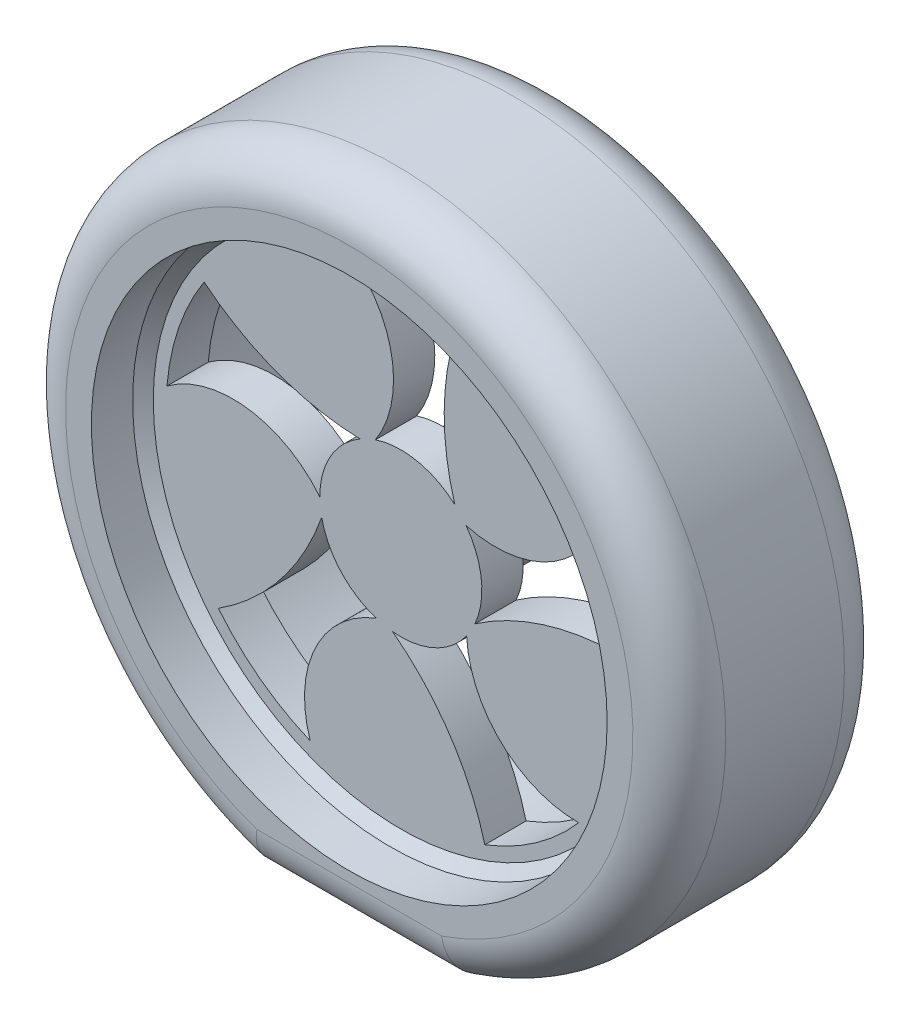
ISO-10303-21;
HEADER;
FILE_DESCRIPTION(('STEP AP214'),'2;1');
FILE_NAME('part.step','',(''),(''),'','','');
FILE_SCHEMA(('AUTOMOTIVE_DESIGN { 1 0 10303 214 1 1 1 1 }'));
ENDSEC;
DATA;
#1=APPLICATION_CONTEXT('core data for automotive mechanical design processes');
#2=APPLICATION_PROTOCOL_DEFINITION('international standard','automotive_design',2000,#1);
#3=PRODUCT_CONTEXT('',#1,'mechanical');
#4=PRODUCT('Part','Part','',(#3));
#5=PRODUCT_RELATED_PRODUCT_CATEGORY('part','',(#4));
#6=PRODUCT_DEFINITION_FORMATION('','',#4);
#7=PRODUCT_DEFINITION_CONTEXT('part definition',#1,'design');
#8=PRODUCT_DEFINITION('design','',#6,#7);
#9=PRODUCT_DEFINITION_SHAPE('','',#8);
#10=(LENGTH_UNIT() NAMED_UNIT(*) SI_UNIT(.MILLI.,.METRE.));
#11=(NAMED_UNIT(*) PLANE_ANGLE_UNIT() SI_UNIT($,.RADIAN.));
#12=(NAMED_UNIT(*) SI_UNIT($,.STERADIAN.) SOLID_ANGLE_UNIT());
#13=UNCERTAINTY_MEASURE_WITH_UNIT(LENGTH_MEASURE(1.E-05),#10,'distance_accuracy_value','');
#14=(GEOMETRIC_REPRESENTATION_CONTEXT(3) GLOBAL_UNCERTAINTY_ASSIGNED_CONTEXT((#13)) GLOBAL_UNIT_ASSIGNED_CONTEXT((#10,
#11,#12)) REPRESENTATION_CONTEXT('',''));
#15=CARTESIAN_POINT('',(0.,0.,0.));
#16=DIRECTION('',(0.,0.,1.));
#17=DIRECTION('',(1.,0.,0.));
#18=AXIS2_PLACEMENT_3D('',#15,#16,#17);
#19=CARTESIAN_POINT('',(0.,0.,115.));
#20=DIRECTION('',(0.,0.,-1.));
#21=DIRECTION('',(-1.,0.,0.));
#22=AXIS2_PLACEMENT_3D('',#19,#20,#21);
#23=PLANE('',#22);
#24=CARTESIAN_POINT('',(0.,0.,115.));
#25=DIRECTION('',(0.,0.,-1.));
#26=DIRECTION('',(-1.,0.,0.));
#27=AXIS2_PLACEMENT_3D('',#24,#25,#26);
#28=CIRCLE('',#27,227.49505489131);
#29=CARTESIAN_POINT('',(-226.727033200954,18.6775912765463,115.));
#30=VERTEX_POINT('',#29);
#31=CARTESIAN_POINT('',(-190.715894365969,124.021964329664,115.));
#32=VERTEX_POINT('',#31);
#33=EDGE_CURVE('E197',#30,#32,#28,.T.);
#34=ORIENTED_EDGE('',*,*,#33,.F.);
#35=CARTESIAN_POINT('',(-162.563216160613,-68.0513113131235,115.));
#36=DIRECTION('',(0.,0.,-1.));
#37=DIRECTION('',(-1.,0.,0.));
#38=AXIS2_PLACEMENT_3D('',#35,#36,#37);
#39=CIRCLE('',#38,107.883724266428);
#40=CARTESIAN_POINT('',(-78.5484642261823,-0.372515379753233,115.));
#41=VERTEX_POINT('',#40);
#42=EDGE_CURVE('E210',#41,#30,#39,.F.);
#43=ORIENTED_EDGE('',*,*,#42,.F.);
#44=CARTESIAN_POINT('',(0.,0.,115.));
#45=DIRECTION('',(0.,0.,-1.));
#46=DIRECTION('',(-1.,0.,0.));
#47=AXIS2_PLACEMENT_3D('',#44,#45,#46);
#48=CIRCLE('',#47,78.5493475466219);
#49=CARTESIAN_POINT('',(-39.5396561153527,67.8720531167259,115.));
#50=VERTEX_POINT('',#49);
#51=EDGE_CURVE('E223',#50,#41,#48,.F.);
#52=ORIENTED_EDGE('',*,*,#51,.F.);
#53=CARTESIAN_POINT('',(-33.3873778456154,316.022259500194,115.));
#54=DIRECTION('',(0.,0.,-1.));
#55=DIRECTION('',(-1.,0.,0.));
#56=AXIS2_PLACEMENT_3D('',#53,#54,#55);
#57=CIRCLE('',#56,248.22646002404);
#58=EDGE_CURVE('E225',#32,#50,#57,.F.);
#59=ORIENTED_EDGE('',*,*,#58,.F.);
#60=EDGE_LOOP('',(#34,#43,#52,#59));
#61=FACE_BOUND('',#60,.T.);
#62=CARTESIAN_POINT('',(0.,0.,115.));
#63=DIRECTION('',(0.,0.,-1.));
#64=DIRECTION('',(-1.,0.,0.));
#65=AXIS2_PLACEMENT_3D('',#62,#63,#64);
#66=CIRCLE('',#65,227.49505489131);
#67=CARTESIAN_POINT('',(-87.8259512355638,-209.858529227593,115.));
#68=VERTEX_POINT('',#67);
#69=CARTESIAN_POINT('',(-176.886349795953,-143.056699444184,115.));
#70=VERTEX_POINT('',#69);
#71=EDGE_CURVE('E255',#68,#70,#66,.T.);
#72=ORIENTED_EDGE('',*,*,#71,.F.);
#73=CARTESIAN_POINT('',(14.4858466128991,-175.635817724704,115.));
#74=DIRECTION('',(0.,0.,-1.));
#75=DIRECTION('',(-1.,0.,0.));
#76=AXIS2_PLACEMENT_3D('',#73,#74,#75);
#77=CIRCLE('',#76,107.883724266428);
#78=CARTESIAN_POINT('',(-23.9185271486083,-74.8191423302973,115.));
#79=VERTEX_POINT('',#78);
#80=EDGE_CURVE('E242',#79,#68,#77,.F.);
#81=ORIENTED_EDGE('',*,*,#80,.F.);
#82=CARTESIAN_POINT('',(0.,0.,115.));
#83=DIRECTION('',(0.,0.,-1.));
#84=DIRECTION('',(-1.,0.,0.));
#85=AXIS2_PLACEMENT_3D('',#82,#83,#84);
#86=CIRCLE('',#85,78.5493475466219);
#87=CARTESIAN_POINT('',(-76.7685840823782,-16.6308297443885,115.));
#88=VERTEX_POINT('',#87);
#89=EDGE_CURVE('E250',#88,#79,#86,.F.);
#90=ORIENTED_EDGE('',*,*,#89,.F.);
#91=CARTESIAN_POINT('',(-310.872296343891,65.9029655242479,115.));
#92=DIRECTION('',(0.,0.,-1.));
#93=DIRECTION('',(-1.,0.,0.));
#94=AXIS2_PLACEMENT_3D('',#91,#92,#93);
#95=CIRCLE('',#94,248.22646002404);
#96=EDGE_CURVE('E253',#70,#88,#95,.F.);
#97=ORIENTED_EDGE('',*,*,#96,.F.);
#98=EDGE_LOOP('',(#72,#81,#90,#97));
#99=FACE_BOUND('',#98,.T.);
#100=CARTESIAN_POINT('',(0.,0.,115.));
#101=DIRECTION('',(0.,0.,-1.));
#102=DIRECTION('',(-1.,0.,0.));
#103=AXIS2_PLACEMENT_3D('',#100,#101,#102);
#104=CIRCLE('',#103,227.49505489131);
#105=CARTESIAN_POINT('',(172.447610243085,-148.377295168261,115.));
#106=VERTEX_POINT('',#105);
#107=CARTESIAN_POINT('',(81.3941180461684,-212.435866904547,115.));
#108=VERTEX_POINT('',#107);
#109=EDGE_CURVE('E284',#106,#108,#104,.T.);
#110=ORIENTED_EDGE('',*,*,#109,.F.);
#111=CARTESIAN_POINT('',(171.515961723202,-40.4975936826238,115.));
#112=DIRECTION('',(0.,0.,-1.));
#113=DIRECTION('',(-1.,0.,0.));
#114=AXIS2_PLACEMENT_3D('',#111,#112,#113);
#115=CIRCLE('',#114,107.883724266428);
#116=CARTESIAN_POINT('',(63.7660014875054,-45.8682575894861,115.));
#117=VERTEX_POINT('',#116);
#118=EDGE_CURVE('E271',#117,#106,#115,.F.);
#119=ORIENTED_EDGE('',*,*,#118,.F.);
#120=CARTESIAN_POINT('',(0.,0.,115.));
#121=DIRECTION('',(0.,0.,-1.));
#122=DIRECTION('',(-1.,0.,0.));
#123=AXIS2_PLACEMENT_3D('',#120,#121,#122);
#124=CIRCLE('',#123,78.5493475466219);
#125=CARTESIAN_POINT('',(-7.90593811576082,-78.1504711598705,115.));
#126=VERTEX_POINT('',#125);
#127=EDGE_CURVE('E279',#126,#117,#124,.F.);
#128=ORIENTED_EDGE('',*,*,#127,.F.);
#129=CARTESIAN_POINT('',(-158.742267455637,-275.291986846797,115.));
#130=DIRECTION('',(0.,0.,-1.));
#131=DIRECTION('',(-1.,0.,0.));
#132=AXIS2_PLACEMENT_3D('',#129,#130,#131);
#133=CIRCLE('',#132,248.22646002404);
#134=EDGE_CURVE('E282',#108,#126,#133,.F.);
#135=ORIENTED_EDGE('',*,*,#134,.F.);
#136=EDGE_LOOP('',(#110,#119,#128,#135));
#137=FACE_BOUND('',#136,.T.);
#138=CARTESIAN_POINT('',(0.,0.,115.));
#139=DIRECTION('',(0.,0.,-1.));
#140=DIRECTION('',(-1.,0.,0.));
#141=AXIS2_PLACEMENT_3D('',#138,#139,#140);
#142=CIRCLE('',#141,227.49505489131);
#143=CARTESIAN_POINT('',(194.404435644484,118.156317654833,115.));
#144=VERTEX_POINT('',#143);
#145=CARTESIAN_POINT('',(227.190681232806,11.7641132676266,115.));
#146=VERTEX_POINT('',#145);
#147=EDGE_CURVE('E313',#144,#146,#142,.T.);
#148=ORIENTED_EDGE('',*,*,#147,.F.);
#149=CARTESIAN_POINT('',(91.5168473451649,150.60692836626,115.));
#150=DIRECTION('',(0.,0.,-1.));
#151=DIRECTION('',(-1.,0.,0.));
#152=AXIS2_PLACEMENT_3D('',#149,#150,#151);
#153=CIRCLE('',#152,107.883724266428);
#154=CARTESIAN_POINT('',(63.3280833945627,46.4710001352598,115.));
#155=VERTEX_POINT('',#154);
#156=EDGE_CURVE('E300',#155,#144,#153,.F.);
#157=ORIENTED_EDGE('',*,*,#156,.F.);
#158=CARTESIAN_POINT('',(0.,0.,115.));
#159=DIRECTION('',(0.,0.,-1.));
#160=DIRECTION('',(-1.,0.,0.));
#161=AXIS2_PLACEMENT_3D('',#158,#159,#160);
#162=CIRCLE('',#161,78.5493475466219);
#163=CARTESIAN_POINT('',(71.8824456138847,-31.6688176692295,115.));
#164=VERTEX_POINT('',#163);
#165=EDGE_CURVE('E308',#164,#155,#162,.F.);
#166=ORIENTED_EDGE('',*,*,#165,.F.);
#167=CARTESIAN_POINT('',(212.764179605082,-236.042770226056,115.));
#168=DIRECTION('',(0.,0.,-1.));
#169=DIRECTION('',(-1.,0.,0.));
#170=AXIS2_PLACEMENT_3D('',#167,#168,#169);
#171=CIRCLE('',#170,248.22646002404);
#172=EDGE_CURVE('E311',#146,#164,#171,.F.);
#173=ORIENTED_EDGE('',*,*,#172,.F.);
#174=EDGE_LOOP('',(#148,#157,#166,#173));
#175=FACE_BOUND('',#174,.T.);
#176=CARTESIAN_POINT('',(0.,0.,115.));
#177=DIRECTION('',(0.,0.,-1.));
#178=DIRECTION('',(-1.,0.,0.));
#179=AXIS2_PLACEMENT_3D('',#176,#177,#178);
#180=CIRCLE('',#179,227.49505489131);
#181=CARTESIAN_POINT('',(-52.2990614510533,221.401915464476,115.));
#182=VERTEX_POINT('',#181);
#183=CARTESIAN_POINT('',(59.0174448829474,219.706488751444,115.));
#184=VERTEX_POINT('',#183);
#185=EDGE_CURVE('E342',#182,#184,#180,.T.);
#186=ORIENTED_EDGE('',*,*,#185,.F.);
#187=CARTESIAN_POINT('',(-114.955439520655,133.577794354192,115.));
#188=DIRECTION('',(0.,0.,-1.));
#189=DIRECTION('',(-1.,0.,0.));
#190=AXIS2_PLACEMENT_3D('',#187,#188,#189);
#191=CIRCLE('',#190,107.883724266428);
#192=CARTESIAN_POINT('',(-24.6270935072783,74.5889151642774,115.));
#193=VERTEX_POINT('',#192);
#194=EDGE_CURVE('E329',#193,#182,#191,.F.);
#195=ORIENTED_EDGE('',*,*,#194,.F.);
#196=CARTESIAN_POINT('',(0.,0.,115.));
#197=DIRECTION('',(0.,0.,-1.));
#198=DIRECTION('',(-1.,0.,0.));
#199=AXIS2_PLACEMENT_3D('',#196,#197,#198);
#200=CIRCLE('',#199,78.5493475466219);
#201=CARTESIAN_POINT('',(52.331732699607,58.5780654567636,115.));
#202=VERTEX_POINT('',#201);
#203=EDGE_CURVE('E337',#202,#193,#200,.F.);
#204=ORIENTED_EDGE('',*,*,#203,.F.);
#205=CARTESIAN_POINT('',(290.237762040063,129.409532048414,115.));
#206=DIRECTION('',(0.,0.,-1.));
#207=DIRECTION('',(-1.,0.,0.));
#208=AXIS2_PLACEMENT_3D('',#205,#206,#207);
#209=CIRCLE('',#208,248.22646002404);
#210=EDGE_CURVE('E340',#184,#202,#209,.F.);
#211=ORIENTED_EDGE('',*,*,#210,.F.);
#212=EDGE_LOOP('',(#186,#195,#204,#211));
#213=FACE_BOUND('',#212,.T.);
#214=CARTESIAN_POINT('',(0.,0.,115.));
#215=DIRECTION('',(0.,0.,-1.));
#216=DIRECTION('',(-1.,0.,0.));
#217=AXIS2_PLACEMENT_3D('',#214,#215,#216);
#218=CIRCLE('',#217,250.);
#219=CARTESIAN_POINT('',(-250.,0.,115.));
#220=VERTEX_POINT('',#219);
#221=EDGE_CURVE('E359',#220,#220,#218,.T.);
#222=ORIENTED_EDGE('',*,*,#221,.T.);
#223=EDGE_LOOP('',(#222));
#224=FACE_BOUND('',#223,.T.);
#225=CARTESIAN_POINT('',(0.,0.,115.));
#226=DIRECTION('',(0.,0.,-1.));
#227=DIRECTION('',(-1.,0.,0.));
#228=AXIS2_PLACEMENT_3D('',#225,#226,#227);
#229=CIRCLE('',#228,55.);
#230=CARTESIAN_POINT('',(-55.,0.,115.));
#231=VERTEX_POINT('',#230);
#232=EDGE_CURVE('E350',#231,#231,#229,.T.);
#233=ORIENTED_EDGE('',*,*,#232,.F.);
#234=EDGE_LOOP('',(#233));
#235=FACE_BOUND('',#234,.T.);
#236=ADVANCED_FACE('F33',(#61,#99,#137,#175,#213,#224,#235),#23,.T.);
#237=CARTESIAN_POINT('',(0.,0.,205.));
#238=DIRECTION('',(0.,0.,-1.));
#239=DIRECTION('',(-1.,0.,0.));
#240=AXIS2_PLACEMENT_3D('',#237,#238,#239);
#241=CYLINDRICAL_SURFACE('',#240,320.);
#242=DIRECTION('',(0.,0.,-1.));
#243=VECTOR('',#242,1.);
#244=CARTESIAN_POINT('',(-96.8245836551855,-305.,205.));
#245=LINE('',#244,#243);
#246=CARTESIAN_POINT('',(-96.8245836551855,-305.,160.));
#247=VERTEX_POINT('',#246);
#248=CARTESIAN_POINT('',(-96.8245836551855,-305.,45.));
#249=VERTEX_POINT('',#248);
#250=EDGE_CURVE('E409',#247,#249,#245,.T.);
#251=ORIENTED_EDGE('',*,*,#250,.F.);
#252=CARTESIAN_POINT('',(0.,0.,160.));
#253=DIRECTION('',(0.,0.,1.));
#254=DIRECTION('',(1.,0.,0.));
#255=AXIS2_PLACEMENT_3D('',#252,#253,#254);
#256=CIRCLE('',#255,320.);
#257=CARTESIAN_POINT('',(96.8245836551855,-305.,160.));
#258=VERTEX_POINT('',#257);
#259=EDGE_CURVE('E420',#247,#258,#256,.F.);
#260=ORIENTED_EDGE('',*,*,#259,.T.);
#261=DIRECTION('',(0.,0.,-1.));
#262=VECTOR('',#261,1.);
#263=CARTESIAN_POINT('',(96.8245836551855,-305.,205.));
#264=LINE('',#263,#262);
#265=CARTESIAN_POINT('',(96.8245836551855,-305.,45.));
#266=VERTEX_POINT('',#265);
#267=EDGE_CURVE('E406',#258,#266,#264,.T.);
#268=ORIENTED_EDGE('',*,*,#267,.T.);
#269=CARTESIAN_POINT('',(0.,0.,45.));
#270=DIRECTION('',(0.,0.,1.));
#271=DIRECTION('',(1.,0.,0.));
#272=AXIS2_PLACEMENT_3D('',#269,#270,#271);
#273=CIRCLE('',#272,320.);
#274=EDGE_CURVE('E417',#266,#249,#273,.T.);
#275=ORIENTED_EDGE('',*,*,#274,.T.);
#276=EDGE_LOOP('',(#251,#260,#268,#275));
#277=FACE_BOUND('',#276,.T.);
#278=ADVANCED_FACE('F35',(#277),#241,.T.);
#279=CARTESIAN_POINT('',(-96.8245836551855,-305.,205.));
#280=DIRECTION('',(0.,1.,0.));
#281=DIRECTION('',(0.,0.,1.));
#282=AXIS2_PLACEMENT_3D('',#279,#280,#281);
#283=PLANE('',#282);
#284=ORIENTED_EDGE('',*,*,#267,.F.);
#285=DIRECTION('',(1.,0.,0.));
#286=VECTOR('',#285,1.);
#287=CARTESIAN_POINT('',(-96.8245836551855,-305.,160.));
#288=LINE('',#287,#286);
#289=EDGE_CURVE('E430',#258,#247,#288,.F.);
#290=ORIENTED_EDGE('',*,*,#289,.T.);
#291=ORIENTED_EDGE('',*,*,#250,.T.);
#292=DIRECTION('',(1.,0.,0.));
#293=VECTOR('',#292,1.);
#294=CARTESIAN_POINT('',(-96.8245836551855,-305.,45.));
#295=LINE('',#294,#293);
#296=EDGE_CURVE('E428',#249,#266,#295,.T.);
#297=ORIENTED_EDGE('',*,*,#296,.T.);
#298=EDGE_LOOP('',(#284,#290,#291,#297));
#299=FACE_BOUND('',#298,.T.);
#300=ADVANCED_FACE('F453',(#299),#283,.F.);
#301=CARTESIAN_POINT('',(0.,0.,205.));
#302=DIRECTION('',(0.,0.,1.));
#303=DIRECTION('',(1.,0.,0.));
#304=AXIS2_PLACEMENT_3D('',#301,#302,#303);
#305=PLANE('',#304);
#306=CARTESIAN_POINT('',(0.,0.,205.));
#307=DIRECTION('',(0.,0.,1.));
#308=DIRECTION('',(1.,0.,0.));
#309=AXIS2_PLACEMENT_3D('',#306,#307,#308);
#310=CIRCLE('',#309,250.);
#311=CARTESIAN_POINT('',(250.,0.,205.));
#312=VERTEX_POINT('',#311);
#313=EDGE_CURVE('E362',#312,#312,#310,.T.);
#314=ORIENTED_EDGE('',*,*,#313,.F.);
#315=EDGE_LOOP('',(#314));
#316=FACE_BOUND('',#315,.T.);
#317=DIRECTION('',(1.,0.,0.));
#318=VECTOR('',#317,1.);
#319=CARTESIAN_POINT('',(96.8245836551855,-260.,205.));
#320=LINE('',#319,#318);
#321=CARTESIAN_POINT('',(-89.5823643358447,-260.,205.));
#322=VERTEX_POINT('',#321);
#323=CARTESIAN_POINT('',(89.5823643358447,-260.,205.));
#324=VERTEX_POINT('',#323);
#325=EDGE_CURVE('E412',#322,#324,#320,.T.);
#326=ORIENTED_EDGE('',*,*,#325,.T.);
#327=CARTESIAN_POINT('',(0.,0.,205.));
#328=DIRECTION('',(0.,0.,1.));
#329=DIRECTION('',(1.,0.,0.));
#330=AXIS2_PLACEMENT_3D('',#327,#328,#329);
#331=CIRCLE('',#330,275.);
#332=EDGE_CURVE('E414',#324,#322,#331,.T.);
#333=ORIENTED_EDGE('',*,*,#332,.T.);
#334=EDGE_LOOP('',(#326,#333));
#335=FACE_BOUND('',#334,.T.);
#336=ADVANCED_FACE('F472',(#316,#335),#305,.T.);
#337=CARTESIAN_POINT('',(0.,0.,0.));
#338=DIRECTION('',(0.,0.,1.));
#339=DIRECTION('',(1.,0.,0.));
#340=AXIS2_PLACEMENT_3D('',#337,#338,#339);
#341=PLANE('',#340);
#342=CARTESIAN_POINT('',(0.,0.,0.));
#343=DIRECTION('',(0.,0.,-1.));
#344=DIRECTION('',(-1.,0.,0.));
#345=AXIS2_PLACEMENT_3D('',#342,#343,#344);
#346=CIRCLE('',#345,250.);
#347=CARTESIAN_POINT('',(-250.,0.,0.));
#348=VERTEX_POINT('',#347);
#349=EDGE_CURVE('E356',#348,#348,#346,.T.);
#350=ORIENTED_EDGE('',*,*,#349,.F.);
#351=EDGE_LOOP('',(#350));
#352=FACE_BOUND('',#351,.T.);
#353=DIRECTION('',(1.,0.,0.));
#354=VECTOR('',#353,1.);
#355=CARTESIAN_POINT('',(0.,-260.,0.));
#356=LINE('',#355,#354);
#357=CARTESIAN_POINT('',(89.5823643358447,-260.,0.));
#358=VERTEX_POINT('',#357);
#359=CARTESIAN_POINT('',(-89.5823643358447,-260.,0.));
#360=VERTEX_POINT('',#359);
#361=EDGE_CURVE('E423',#358,#360,#356,.F.);
#362=ORIENTED_EDGE('',*,*,#361,.T.);
#363=CARTESIAN_POINT('',(0.,0.,0.));
#364=DIRECTION('',(0.,0.,1.));
#365=DIRECTION('',(1.,0.,0.));
#366=AXIS2_PLACEMENT_3D('',#363,#364,#365);
#367=CIRCLE('',#366,275.);
#368=EDGE_CURVE('E425',#360,#358,#367,.F.);
#369=ORIENTED_EDGE('',*,*,#368,.T.);
#370=EDGE_LOOP('',(#362,#369));
#371=FACE_BOUND('',#370,.T.);
#372=ADVANCED_FACE('F475',(#352,#371),#341,.F.);
#373=CARTESIAN_POINT('',(0.,-260.,160.));
#374=DIRECTION('',(-1.,0.,0.));
#375=DIRECTION('',(0.,0.,1.));
#376=AXIS2_PLACEMENT_3D('',#373,#374,#375);
#377=CYLINDRICAL_SURFACE('',#376,45.);
#378=CARTESIAN_POINT('',(-96.8245836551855,-305.,160.));
#379=CARTESIAN_POINT('',(-96.8245846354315,-305.000008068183,160.627283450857));
#380=CARTESIAN_POINT('',(-96.8225517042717,-304.986883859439,161.254560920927));
#381=CARTESIAN_POINT('',(-96.8144256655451,-304.934432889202,162.507990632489));
#382=CARTESIAN_POINT('',(-96.8083325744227,-304.895106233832,163.134142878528));
#383=CARTESIAN_POINT('',(-96.7920944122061,-304.790315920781,164.384171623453));
#384=CARTESIAN_POINT('',(-96.7819496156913,-304.724854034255,165.008048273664));
#385=CARTESIAN_POINT('',(-96.7576261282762,-304.567935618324,166.252400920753));
#386=CARTESIAN_POINT('',(-96.7434474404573,-304.476479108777,166.872876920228));
#387=CARTESIAN_POINT('',(-96.6949208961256,-304.163555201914,168.72631461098));
#388=CARTESIAN_POINT('',(-96.654562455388,-303.903403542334,169.952831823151));
#389=CARTESIAN_POINT('',(-96.5580673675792,-303.281935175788,172.379134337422));
#390=CARTESIAN_POINT('',(-96.5019308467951,-302.920619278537,173.578919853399));
#391=CARTESIAN_POINT('',(-96.3741956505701,-302.099383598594,175.943937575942));
#392=CARTESIAN_POINT('',(-96.3025914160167,-301.639428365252,177.109157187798));
#393=CARTESIAN_POINT('',(-96.1443703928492,-300.624456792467,179.396365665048));
#394=CARTESIAN_POINT('',(-96.0577534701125,-300.069439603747,180.518354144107));
#395=CARTESIAN_POINT('',(-95.8700488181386,-298.868581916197,182.711135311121));
#396=CARTESIAN_POINT('',(-95.7689632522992,-298.222754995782,183.78193562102));
#397=CARTESIAN_POINT('',(-95.5529260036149,-296.84500014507,185.865140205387));
#398=CARTESIAN_POINT('',(-95.437974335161,-296.113072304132,186.877544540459));
#399=CARTESIAN_POINT('',(-95.1943049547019,-294.564692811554,188.841873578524));
#400=CARTESIAN_POINT('',(-95.0655225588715,-293.747844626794,189.793477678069));
#401=CARTESIAN_POINT('',(-94.795443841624,-292.038598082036,191.624304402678));
#402=CARTESIAN_POINT('',(-94.6541474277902,-291.146199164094,192.503526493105));
#403=CARTESIAN_POINT('',(-94.3598595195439,-289.292047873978,194.183940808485));
#404=CARTESIAN_POINT('',(-94.2068646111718,-288.330275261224,194.985110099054));
#405=CARTESIAN_POINT('',(-93.8901509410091,-286.344512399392,196.503823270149));
#406=CARTESIAN_POINT('',(-93.7264322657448,-285.320522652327,197.221367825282));
#407=CARTESIAN_POINT('',(-93.387348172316,-283.205591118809,198.575838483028));
#408=CARTESIAN_POINT('',(-93.211871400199,-282.114019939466,199.211754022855));
#409=CARTESIAN_POINT('',(-92.8520532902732,-279.882381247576,200.389139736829));
#410=CARTESIAN_POINT('',(-92.6677113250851,-278.742310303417,200.930603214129));
#411=CARTESIAN_POINT('',(-92.2914178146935,-276.422347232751,201.915319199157));
#412=CARTESIAN_POINT('',(-92.0994695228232,-275.242472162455,202.358613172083));
#413=CARTESIAN_POINT('',(-91.709130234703,-272.85088358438,203.144388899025));
#414=CARTESIAN_POINT('',(-91.5107408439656,-271.639178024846,203.486895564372));
#415=CARTESIAN_POINT('',(-91.1705310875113,-269.568210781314,203.979642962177));
#416=CARTESIAN_POINT('',(-91.0300477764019,-268.714985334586,204.156626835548));
#417=CARTESIAN_POINT('',(-90.7470159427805,-267.000029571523,204.460743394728));
#418=CARTESIAN_POINT('',(-90.6044675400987,-266.138299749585,204.587878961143));
#419=CARTESIAN_POINT('',(-90.3179918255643,-264.410638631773,204.791760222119));
#420=CARTESIAN_POINT('',(-90.1740671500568,-263.544716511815,204.868587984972));
#421=CARTESIAN_POINT('',(-89.8850807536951,-261.810229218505,204.971962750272));
#422=CARTESIAN_POINT('',(-89.7400193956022,-260.941664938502,204.99852518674));
#423=CARTESIAN_POINT('',(-89.5905480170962,-260.048875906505,204.999980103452));
#424=CARTESIAN_POINT('',(-89.586456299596,-260.02443785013,205.000000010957));
#425=CARTESIAN_POINT('',(-89.5823643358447,-260.,205.));
#426=B_SPLINE_CURVE_WITH_KNOTS('',3,(#378,#379,#380,#381,#382,#383,#384,#385,#386,#387,#388,
#389,#390,#391,#392,#393,#394,#395,#396,#397,#398,#399,#400,#401,#402,#403,#404,#405,#406,#407,
#408,#409,#410,#411,#412,#413,#414,#415,#416,#417,#418,#419,#420,#421,#422,#423,#424,#425),
.UNSPECIFIED.,.F.,.F.,(4,2,2,2,2,2,2,2,2,2,2,2,2,2,2,2,2,2,2,2,2,2,2,4),(0.,1.88169823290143,
3.76338884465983,5.6449519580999,7.5265136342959,11.2849976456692,15.0434515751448,
18.8032585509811,22.5630991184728,26.3223780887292,30.0816531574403,33.8593457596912,
37.6370662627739,41.4158934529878,45.1946901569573,49.0164973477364,52.8385754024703,
56.6590359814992,60.4785514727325,63.1251395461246,65.77157465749,68.4136817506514,
71.0549774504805,71.1293121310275),.UNSPECIFIED.);
#427=EDGE_CURVE('E396',#247,#322,#426,.T.);
#428=ORIENTED_EDGE('',*,*,#427,.F.);
#429=ORIENTED_EDGE('',*,*,#289,.F.);
#430=CARTESIAN_POINT('',(96.8245836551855,-305.,160.));
#431=CARTESIAN_POINT('',(96.8245846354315,-305.000008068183,160.627283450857));
#432=CARTESIAN_POINT('',(96.8225517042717,-304.986883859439,161.254560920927));
#433=CARTESIAN_POINT('',(96.8144256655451,-304.934432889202,162.507990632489));
#434=CARTESIAN_POINT('',(96.8083325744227,-304.895106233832,163.134142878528));
#435=CARTESIAN_POINT('',(96.7920944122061,-304.790315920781,164.384171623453));
#436=CARTESIAN_POINT('',(96.7819496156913,-304.724854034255,165.008048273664));
#437=CARTESIAN_POINT('',(96.7576261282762,-304.567935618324,166.252400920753));
#438=CARTESIAN_POINT('',(96.7434474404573,-304.476479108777,166.872876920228));
#439=CARTESIAN_POINT('',(96.6949208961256,-304.163555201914,168.72631461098));
#440=CARTESIAN_POINT('',(96.654562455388,-303.903403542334,169.952831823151));
#441=CARTESIAN_POINT('',(96.5580673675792,-303.281935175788,172.379134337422));
#442=CARTESIAN_POINT('',(96.5019308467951,-302.920619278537,173.578919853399));
#443=CARTESIAN_POINT('',(96.3741956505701,-302.099383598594,175.943937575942));
#444=CARTESIAN_POINT('',(96.3025914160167,-301.639428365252,177.109157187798));
#445=CARTESIAN_POINT('',(96.1443703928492,-300.624456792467,179.396365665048));
#446=CARTESIAN_POINT('',(96.0577534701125,-300.069439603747,180.518354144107));
#447=CARTESIAN_POINT('',(95.8700488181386,-298.868581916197,182.711135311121));
#448=CARTESIAN_POINT('',(95.7689632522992,-298.222754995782,183.78193562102));
#449=CARTESIAN_POINT('',(95.5529260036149,-296.84500014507,185.865140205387));
#450=CARTESIAN_POINT('',(95.437974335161,-296.113072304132,186.877544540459));
#451=CARTESIAN_POINT('',(95.1943049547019,-294.564692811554,188.841873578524));
#452=CARTESIAN_POINT('',(95.0655225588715,-293.747844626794,189.793477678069));
#453=CARTESIAN_POINT('',(94.795443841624,-292.038598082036,191.624304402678));
#454=CARTESIAN_POINT('',(94.6541474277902,-291.146199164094,192.503526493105));
#455=CARTESIAN_POINT('',(94.3598595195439,-289.292047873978,194.183940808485));
#456=CARTESIAN_POINT('',(94.2068646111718,-288.330275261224,194.985110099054));
#457=CARTESIAN_POINT('',(93.8901509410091,-286.344512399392,196.503823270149));
#458=CARTESIAN_POINT('',(93.7264322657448,-285.320522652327,197.221367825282));
#459=CARTESIAN_POINT('',(93.387348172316,-283.205591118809,198.575838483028));
#460=CARTESIAN_POINT('',(93.211871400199,-282.114019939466,199.211754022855));
#461=CARTESIAN_POINT('',(92.8520532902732,-279.882381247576,200.389139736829));
#462=CARTESIAN_POINT('',(92.6677113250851,-278.742310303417,200.930603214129));
#463=CARTESIAN_POINT('',(92.2914178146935,-276.422347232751,201.915319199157));
#464=CARTESIAN_POINT('',(92.0994695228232,-275.242472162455,202.358613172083));
#465=CARTESIAN_POINT('',(91.709130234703,-272.85088358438,203.144388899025));
#466=CARTESIAN_POINT('',(91.5107408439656,-271.639178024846,203.486895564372));
#467=CARTESIAN_POINT('',(91.1705310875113,-269.568210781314,203.979642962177));
#468=CARTESIAN_POINT('',(91.0300477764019,-268.714985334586,204.156626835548));
#469=CARTESIAN_POINT('',(90.7470159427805,-267.000029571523,204.460743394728));
#470=CARTESIAN_POINT('',(90.6044675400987,-266.138299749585,204.587878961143));
#471=CARTESIAN_POINT('',(90.3179918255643,-264.410638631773,204.791760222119));
#472=CARTESIAN_POINT('',(90.1740671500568,-263.544716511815,204.868587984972));
#473=CARTESIAN_POINT('',(89.8850807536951,-261.810229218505,204.971962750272));
#474=CARTESIAN_POINT('',(89.7400193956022,-260.941664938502,204.99852518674));
#475=CARTESIAN_POINT('',(89.5905480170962,-260.048875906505,204.999980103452));
#476=CARTESIAN_POINT('',(89.586456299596,-260.02443785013,205.000000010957));
#477=CARTESIAN_POINT('',(89.5823643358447,-260.,205.));
#478=B_SPLINE_CURVE_WITH_KNOTS('',3,(#430,#431,#432,#433,#434,#435,#436,#437,#438,#439,#440,
#441,#442,#443,#444,#445,#446,#447,#448,#449,#450,#451,#452,#453,#454,#455,#456,#457,#458,#459,
#460,#461,#462,#463,#464,#465,#466,#467,#468,#469,#470,#471,#472,#473,#474,#475,#476,#477),
.UNSPECIFIED.,.F.,.F.,(4,2,2,2,2,2,2,2,2,2,2,2,2,2,2,2,2,2,2,2,2,2,2,4),(0.,1.88169823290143,
3.76338884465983,5.6449519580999,7.5265136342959,11.2849976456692,15.0434515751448,
18.8032585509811,22.5630991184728,26.3223780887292,30.0816531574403,33.8593457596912,
37.6370662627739,41.4158934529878,45.1946901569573,49.0164973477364,52.8385754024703,
56.6590359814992,60.4785514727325,63.1251395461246,65.77157465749,68.4136817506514,
71.0549774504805,71.1293121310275),.UNSPECIFIED.);
#479=EDGE_CURVE('E401',#324,#258,#478,.F.);
#480=ORIENTED_EDGE('',*,*,#479,.F.);
#481=ORIENTED_EDGE('',*,*,#325,.F.);
#482=EDGE_LOOP('',(#428,#429,#480,#481));
#483=FACE_BOUND('',#482,.T.);
#484=ADVANCED_FACE('F391',(#483),#377,.T.);
#485=CARTESIAN_POINT('',(0.,0.,160.));
#486=DIRECTION('',(0.,0.,1.));
#487=DIRECTION('',(1.,0.,0.));
#488=AXIS2_PLACEMENT_3D('',#485,#486,#487);
#489=TOROIDAL_SURFACE('',#488,275.,45.);
#490=ORIENTED_EDGE('',*,*,#479,.T.);
#491=ORIENTED_EDGE('',*,*,#259,.F.);
#492=ORIENTED_EDGE('',*,*,#427,.T.);
#493=ORIENTED_EDGE('',*,*,#332,.F.);
#494=EDGE_LOOP('',(#490,#491,#492,#493));
#495=FACE_BOUND('',#494,.T.);
#496=ADVANCED_FACE('F386',(#495),#489,.T.);
#497=CARTESIAN_POINT('',(-96.8245836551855,-260.,45.));
#498=DIRECTION('',(1.,0.,0.));
#499=DIRECTION('',(0.,0.,-1.));
#500=AXIS2_PLACEMENT_3D('',#497,#498,#499);
#501=CYLINDRICAL_SURFACE('',#500,45.);
#502=CARTESIAN_POINT('',(-96.8245836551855,-305.,45.));
#503=CARTESIAN_POINT('',(-96.8245846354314,-305.000008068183,44.3727165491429));
#504=CARTESIAN_POINT('',(-96.8225517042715,-304.986883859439,43.7454390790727));
#505=CARTESIAN_POINT('',(-96.8144256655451,-304.934432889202,42.4920093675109));
#506=CARTESIAN_POINT('',(-96.8083325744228,-304.895106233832,41.8658571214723));
#507=CARTESIAN_POINT('',(-96.7920944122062,-304.790315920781,40.6158283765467));
#508=CARTESIAN_POINT('',(-96.7819496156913,-304.724854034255,39.9919517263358));
#509=CARTESIAN_POINT('',(-96.7576261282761,-304.567935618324,38.7475990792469));
#510=CARTESIAN_POINT('',(-96.7434474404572,-304.476479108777,38.1271230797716));
#511=CARTESIAN_POINT('',(-96.6949208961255,-304.163555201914,36.27368538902));
#512=CARTESIAN_POINT('',(-96.6545624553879,-303.903403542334,35.0471681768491));
#513=CARTESIAN_POINT('',(-96.5580673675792,-303.281935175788,32.6208656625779));
#514=CARTESIAN_POINT('',(-96.5019308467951,-302.920619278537,31.4210801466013));
#515=CARTESIAN_POINT('',(-96.3741956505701,-302.099383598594,29.0560624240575));
#516=CARTESIAN_POINT('',(-96.3025914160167,-301.639428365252,27.8908428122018));
#517=CARTESIAN_POINT('',(-96.1443703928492,-300.624456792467,25.6036343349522));
#518=CARTESIAN_POINT('',(-96.0577534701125,-300.069439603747,24.4816458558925));
#519=CARTESIAN_POINT('',(-95.8700488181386,-298.868581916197,22.2888646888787));
#520=CARTESIAN_POINT('',(-95.7689632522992,-298.222754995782,21.2180643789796));
#521=CARTESIAN_POINT('',(-95.5529260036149,-296.84500014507,19.1348597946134));
#522=CARTESIAN_POINT('',(-95.4379743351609,-296.113072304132,18.1224554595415));
#523=CARTESIAN_POINT('',(-95.1943049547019,-294.564692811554,16.1581264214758));
#524=CARTESIAN_POINT('',(-95.0655225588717,-293.747844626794,15.206522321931));
#525=CARTESIAN_POINT('',(-94.7954438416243,-292.038598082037,13.3756955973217));
#526=CARTESIAN_POINT('',(-94.6541474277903,-291.146199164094,12.4964735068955));
#527=CARTESIAN_POINT('',(-94.359859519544,-289.292047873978,10.8160591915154));
#528=CARTESIAN_POINT('',(-94.2068646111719,-288.330275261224,10.0148899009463));
#529=CARTESIAN_POINT('',(-93.8901509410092,-286.344512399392,8.4961767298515));
#530=CARTESIAN_POINT('',(-93.7264322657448,-285.320522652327,7.77863217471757));
#531=CARTESIAN_POINT('',(-93.3873481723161,-283.205591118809,6.42416151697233));
#532=CARTESIAN_POINT('',(-93.2118714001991,-282.114019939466,5.78824597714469));
#533=CARTESIAN_POINT('',(-92.8520532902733,-279.882381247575,4.61086026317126));
#534=CARTESIAN_POINT('',(-92.667711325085,-278.742310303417,4.06939678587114));
#535=CARTESIAN_POINT('',(-92.2914178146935,-276.42234723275,3.08468080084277));
#536=CARTESIAN_POINT('',(-92.0994695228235,-275.242472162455,2.64138682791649));
#537=CARTESIAN_POINT('',(-91.7091302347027,-272.85088358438,1.85561110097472));
#538=CARTESIAN_POINT('',(-91.5107408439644,-271.639178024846,1.51310443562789));
#539=CARTESIAN_POINT('',(-91.170531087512,-269.568210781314,1.02035703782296));
#540=CARTESIAN_POINT('',(-91.0300477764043,-268.714985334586,0.843373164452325));
#541=CARTESIAN_POINT('',(-90.7470159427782,-267.000029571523,0.539256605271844));
#542=CARTESIAN_POINT('',(-90.6044675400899,-266.138299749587,0.412121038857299));
#543=CARTESIAN_POINT('',(-90.3179918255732,-264.410638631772,0.208239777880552));
#544=CARTESIAN_POINT('',(-90.17406715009,-263.54471651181,0.131412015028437));
#545=CARTESIAN_POINT('',(-89.8850807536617,-261.810229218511,0.0280372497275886));
#546=CARTESIAN_POINT('',(-89.7400193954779,-260.941664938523,0.00147481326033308));
#547=CARTESIAN_POINT('',(-89.5905480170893,-260.048875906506,1.98965484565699E-05));
#548=CARTESIAN_POINT('',(-89.5864562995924,-260.024437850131,-1.09566253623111E-08));
#549=CARTESIAN_POINT('',(-89.5823643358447,-260.,0.));
#550=B_SPLINE_CURVE_WITH_KNOTS('',3,(#502,#503,#504,#505,#506,#507,#508,#509,#510,#511,#512,
#513,#514,#515,#516,#517,#518,#519,#520,#521,#522,#523,#524,#525,#526,#527,#528,#529,#530,#531,
#532,#533,#534,#535,#536,#537,#538,#539,#540,#541,#542,#543,#544,#545,#546,#547,#548,#549),
.UNSPECIFIED.,.F.,.F.,(4,2,2,2,2,2,2,2,2,2,2,2,2,2,2,2,2,2,2,2,2,2,2,4),(0.,1.88169823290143,
3.76338884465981,5.64495195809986,7.52651363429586,11.2849976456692,15.0434515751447,
18.8032585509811,22.5630991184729,26.3223780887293,30.0816531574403,33.8593457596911,
37.6370662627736,41.4158934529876,45.1946901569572,49.0164973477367,52.8385754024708,
56.6590359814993,60.4785514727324,63.1251395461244,65.7715746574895,68.413681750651,
71.0549774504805,71.1293121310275),.UNSPECIFIED.);
#551=EDGE_CURVE('E365',#360,#249,#550,.F.);
#552=ORIENTED_EDGE('',*,*,#551,.F.);
#553=ORIENTED_EDGE('',*,*,#361,.F.);
#554=CARTESIAN_POINT('',(96.8245836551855,-305.,45.));
#555=CARTESIAN_POINT('',(96.8245846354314,-305.000008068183,44.3727165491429));
#556=CARTESIAN_POINT('',(96.8225517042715,-304.986883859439,43.7454390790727));
#557=CARTESIAN_POINT('',(96.8144256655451,-304.934432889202,42.4920093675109));
#558=CARTESIAN_POINT('',(96.8083325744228,-304.895106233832,41.8658571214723));
#559=CARTESIAN_POINT('',(96.7920944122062,-304.790315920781,40.6158283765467));
#560=CARTESIAN_POINT('',(96.7819496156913,-304.724854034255,39.9919517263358));
#561=CARTESIAN_POINT('',(96.7576261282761,-304.567935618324,38.7475990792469));
#562=CARTESIAN_POINT('',(96.7434474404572,-304.476479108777,38.1271230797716));
#563=CARTESIAN_POINT('',(96.6949208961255,-304.163555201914,36.27368538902));
#564=CARTESIAN_POINT('',(96.6545624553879,-303.903403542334,35.0471681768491));
#565=CARTESIAN_POINT('',(96.5580673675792,-303.281935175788,32.6208656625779));
#566=CARTESIAN_POINT('',(96.5019308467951,-302.920619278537,31.4210801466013));
#567=CARTESIAN_POINT('',(96.3741956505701,-302.099383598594,29.0560624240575));
#568=CARTESIAN_POINT('',(96.3025914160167,-301.639428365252,27.8908428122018));
#569=CARTESIAN_POINT('',(96.1443703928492,-300.624456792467,25.6036343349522));
#570=CARTESIAN_POINT('',(96.0577534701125,-300.069439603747,24.4816458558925));
#571=CARTESIAN_POINT('',(95.8700488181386,-298.868581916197,22.2888646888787));
#572=CARTESIAN_POINT('',(95.7689632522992,-298.222754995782,21.2180643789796));
#573=CARTESIAN_POINT('',(95.5529260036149,-296.84500014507,19.1348597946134));
#574=CARTESIAN_POINT('',(95.4379743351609,-296.113072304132,18.1224554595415));
#575=CARTESIAN_POINT('',(95.1943049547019,-294.564692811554,16.1581264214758));
#576=CARTESIAN_POINT('',(95.0655225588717,-293.747844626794,15.206522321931));
#577=CARTESIAN_POINT('',(94.7954438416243,-292.038598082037,13.3756955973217));
#578=CARTESIAN_POINT('',(94.6541474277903,-291.146199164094,12.4964735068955));
#579=CARTESIAN_POINT('',(94.359859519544,-289.292047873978,10.8160591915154));
#580=CARTESIAN_POINT('',(94.2068646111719,-288.330275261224,10.0148899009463));
#581=CARTESIAN_POINT('',(93.8901509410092,-286.344512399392,8.49617672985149));
#582=CARTESIAN_POINT('',(93.7264322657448,-285.320522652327,7.77863217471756));
#583=CARTESIAN_POINT('',(93.387348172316,-283.205591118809,6.42416151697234));
#584=CARTESIAN_POINT('',(93.211871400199,-282.114019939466,5.78824597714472));
#585=CARTESIAN_POINT('',(92.8520532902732,-279.882381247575,4.61086026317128));
#586=CARTESIAN_POINT('',(92.667711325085,-278.742310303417,4.06939678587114));
#587=CARTESIAN_POINT('',(92.2914178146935,-276.42234723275,3.08468080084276));
#588=CARTESIAN_POINT('',(92.0994695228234,-275.242472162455,2.64138682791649));
#589=CARTESIAN_POINT('',(91.7091302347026,-272.85088358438,1.85561110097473));
#590=CARTESIAN_POINT('',(91.5107408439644,-271.639178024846,1.5131044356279));
#591=CARTESIAN_POINT('',(91.170531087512,-269.568210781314,1.02035703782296));
#592=CARTESIAN_POINT('',(91.0300477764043,-268.714985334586,0.84337316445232));
#593=CARTESIAN_POINT('',(90.7470159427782,-267.000029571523,0.539256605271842));
#594=CARTESIAN_POINT('',(90.60446754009,-266.138299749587,0.412121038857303));
#595=CARTESIAN_POINT('',(90.3179918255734,-264.410638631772,0.208239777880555));
#596=CARTESIAN_POINT('',(90.1740671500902,-263.54471651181,0.131412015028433));
#597=CARTESIAN_POINT('',(89.8850807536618,-261.810229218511,0.0280372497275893));
#598=CARTESIAN_POINT('',(89.7400193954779,-260.941664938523,0.00147481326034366));
#599=CARTESIAN_POINT('',(89.5905480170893,-260.048875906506,1.98965484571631E-05));
#600=CARTESIAN_POINT('',(89.5864562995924,-260.024437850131,-1.0956625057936E-08));
#601=CARTESIAN_POINT('',(89.5823643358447,-260.,0.));
#602=B_SPLINE_CURVE_WITH_KNOTS('',3,(#554,#555,#556,#557,#558,#559,#560,#561,#562,#563,#564,
#565,#566,#567,#568,#569,#570,#571,#572,#573,#574,#575,#576,#577,#578,#579,#580,#581,#582,#583,
#584,#585,#586,#587,#588,#589,#590,#591,#592,#593,#594,#595,#596,#597,#598,#599,#600,#601),
.UNSPECIFIED.,.F.,.F.,(4,2,2,2,2,2,2,2,2,2,2,2,2,2,2,2,2,2,2,2,2,2,2,4),(0.,1.88169823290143,
3.76338884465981,5.64495195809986,7.52651363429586,11.2849976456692,15.0434515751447,
18.8032585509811,22.5630991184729,26.3223780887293,30.0816531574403,33.8593457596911,
37.6370662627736,41.4158934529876,45.1946901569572,49.0164973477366,52.8385754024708,
56.6590359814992,60.4785514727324,63.1251395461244,65.7715746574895,68.4136817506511,
71.0549774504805,71.1293121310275),.UNSPECIFIED.);
#603=EDGE_CURVE('E372',#266,#358,#602,.T.);
#604=ORIENTED_EDGE('',*,*,#603,.F.);
#605=ORIENTED_EDGE('',*,*,#296,.F.);
#606=EDGE_LOOP('',(#552,#553,#604,#605));
#607=FACE_BOUND('',#606,.T.);
#608=ADVANCED_FACE('F377',(#607),#501,.T.);
#609=CARTESIAN_POINT('',(0.,0.,45.));
#610=DIRECTION('',(0.,0.,1.));
#611=DIRECTION('',(1.,0.,0.));
#612=AXIS2_PLACEMENT_3D('',#609,#610,#611);
#613=TOROIDAL_SURFACE('',#612,275.,45.);
#614=ORIENTED_EDGE('',*,*,#603,.T.);
#615=ORIENTED_EDGE('',*,*,#368,.F.);
#616=ORIENTED_EDGE('',*,*,#551,.T.);
#617=ORIENTED_EDGE('',*,*,#274,.F.);
#618=EDGE_LOOP('',(#614,#615,#616,#617));
#619=FACE_BOUND('',#618,.T.);
#620=ADVANCED_FACE('F380',(#619),#613,.T.);
#621=CARTESIAN_POINT('',(0.,0.,155.));
#622=DIRECTION('',(0.,0.,1.));
#623=DIRECTION('',(1.,0.,0.));
#624=AXIS2_PLACEMENT_3D('',#621,#622,#623);
#625=CYLINDRICAL_SURFACE('',#624,250.);
#626=CARTESIAN_POINT('',(0.,0.,165.));
#627=DIRECTION('',(0.,0.,1.));
#628=DIRECTION('',(1.,0.,0.));
#629=AXIS2_PLACEMENT_3D('',#626,#627,#628);
#630=CIRCLE('',#629,250.);
#631=CARTESIAN_POINT('',(250.,0.,165.));
#632=VERTEX_POINT('',#631);
#633=EDGE_CURVE('E11',#632,#632,#630,.F.);
#634=ORIENTED_EDGE('',*,*,#633,.T.);
#635=EDGE_LOOP('',(#634));
#636=FACE_BOUND('',#635,.T.);
#637=ORIENTED_EDGE('',*,*,#313,.T.);
#638=EDGE_LOOP('',(#637));
#639=FACE_BOUND('',#638,.T.);
#640=ADVANCED_FACE('F384',(#636,#639),#625,.F.);
#641=CARTESIAN_POINT('',(0.,0.,155.));
#642=DIRECTION('',(0.,0.,1.));
#643=DIRECTION('',(1.,0.,0.));
#644=AXIS2_PLACEMENT_3D('',#641,#642,#643);
#645=PLANE('',#644);
#646=CARTESIAN_POINT('',(0.,0.,155.));
#647=DIRECTION('',(0.,0.,1.));
#648=DIRECTION('',(1.,0.,0.));
#649=AXIS2_PLACEMENT_3D('',#646,#647,#648);
#650=CIRCLE('',#649,240.);
#651=CARTESIAN_POINT('',(240.,0.,155.));
#652=VERTEX_POINT('',#651);
#653=EDGE_CURVE('E41',#652,#652,#650,.T.);
#654=ORIENTED_EDGE('',*,*,#653,.T.);
#655=EDGE_LOOP('',(#654));
#656=FACE_BOUND('',#655,.T.);
#657=CARTESIAN_POINT('',(0.,0.,155.));
#658=DIRECTION('',(0.,0.,1.));
#659=DIRECTION('',(1.,0.,0.));
#660=AXIS2_PLACEMENT_3D('',#657,#658,#659);
#661=CIRCLE('',#660,227.49505489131);
#662=CARTESIAN_POINT('',(-190.715894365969,124.021964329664,155.));
#663=VERTEX_POINT('',#662);
#664=CARTESIAN_POINT('',(-226.727033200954,18.6775912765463,155.));
#665=VERTEX_POINT('',#664);
#666=EDGE_CURVE('E56',#663,#665,#661,.T.);
#667=ORIENTED_EDGE('',*,*,#666,.F.);
#668=CARTESIAN_POINT('',(-33.3873778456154,316.022259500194,155.));
#669=DIRECTION('',(0.,0.,-1.));
#670=DIRECTION('',(1.,0.,0.));
#671=AXIS2_PLACEMENT_3D('',#668,#669,#670);
#672=CIRCLE('',#671,248.22646002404);
#673=CARTESIAN_POINT('',(-39.5396561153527,67.8720531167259,155.));
#674=VERTEX_POINT('',#673);
#675=EDGE_CURVE('E204',#674,#663,#672,.T.);
#676=ORIENTED_EDGE('',*,*,#675,.F.);
#677=CARTESIAN_POINT('',(0.,0.,155.));
#678=DIRECTION('',(0.,0.,-1.));
#679=DIRECTION('',(1.,0.,0.));
#680=AXIS2_PLACEMENT_3D('',#677,#678,#679);
#681=CIRCLE('',#680,78.5493475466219);
#682=CARTESIAN_POINT('',(-78.5484642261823,-0.372515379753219,155.));
#683=VERTEX_POINT('',#682);
#684=EDGE_CURVE('E211',#683,#674,#681,.T.);
#685=ORIENTED_EDGE('',*,*,#684,.F.);
#686=CARTESIAN_POINT('',(-162.563216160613,-68.0513113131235,155.));
#687=DIRECTION('',(0.,0.,-1.));
#688=DIRECTION('',(-1.,0.,0.));
#689=AXIS2_PLACEMENT_3D('',#686,#687,#688);
#690=CIRCLE('',#689,107.883724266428);
#691=EDGE_CURVE('E216',#665,#683,#690,.T.);
#692=ORIENTED_EDGE('',*,*,#691,.F.);
#693=EDGE_LOOP('',(#667,#676,#685,#692));
#694=FACE_BOUND('',#693,.T.);
#695=CARTESIAN_POINT('',(0.,0.,155.));
#696=DIRECTION('',(0.,0.,1.));
#697=DIRECTION('',(1.,0.,0.));
#698=AXIS2_PLACEMENT_3D('',#695,#696,#697);
#699=CIRCLE('',#698,227.49505489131);
#700=CARTESIAN_POINT('',(-176.886349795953,-143.056699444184,155.));
#701=VERTEX_POINT('',#700);
#702=CARTESIAN_POINT('',(-87.8259512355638,-209.858529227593,155.));
#703=VERTEX_POINT('',#702);
#704=EDGE_CURVE('E228',#701,#703,#699,.T.);
#705=ORIENTED_EDGE('',*,*,#704,.F.);
#706=CARTESIAN_POINT('',(-310.872296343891,65.9029655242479,155.));
#707=DIRECTION('',(0.,0.,-1.));
#708=DIRECTION('',(1.,0.,0.));
#709=AXIS2_PLACEMENT_3D('',#706,#707,#708);
#710=CIRCLE('',#709,248.22646002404);
#711=CARTESIAN_POINT('',(-76.7685840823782,-16.6308297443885,155.));
#712=VERTEX_POINT('',#711);
#713=EDGE_CURVE('E236',#712,#701,#710,.T.);
#714=ORIENTED_EDGE('',*,*,#713,.F.);
#715=CARTESIAN_POINT('',(0.,0.,155.));
#716=DIRECTION('',(0.,0.,-1.));
#717=DIRECTION('',(1.,0.,0.));
#718=AXIS2_PLACEMENT_3D('',#715,#716,#717);
#719=CIRCLE('',#718,78.5493475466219);
#720=CARTESIAN_POINT('',(-23.9185271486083,-74.8191423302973,155.));
#721=VERTEX_POINT('',#720);
#722=EDGE_CURVE('E233',#721,#712,#719,.T.);
#723=ORIENTED_EDGE('',*,*,#722,.F.);
#724=CARTESIAN_POINT('',(14.4858466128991,-175.635817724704,155.));
#725=DIRECTION('',(0.,0.,-1.));
#726=DIRECTION('',(-1.,0.,0.));
#727=AXIS2_PLACEMENT_3D('',#724,#725,#726);
#728=CIRCLE('',#727,107.883724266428);
#729=EDGE_CURVE('E230',#703,#721,#728,.T.);
#730=ORIENTED_EDGE('',*,*,#729,.F.);
#731=EDGE_LOOP('',(#705,#714,#723,#730));
#732=FACE_BOUND('',#731,.T.);
#733=CARTESIAN_POINT('',(0.,0.,155.));
#734=DIRECTION('',(0.,0.,1.));
#735=DIRECTION('',(1.,0.,0.));
#736=AXIS2_PLACEMENT_3D('',#733,#734,#735);
#737=CIRCLE('',#736,227.49505489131);
#738=CARTESIAN_POINT('',(81.3941180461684,-212.435866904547,155.));
#739=VERTEX_POINT('',#738);
#740=CARTESIAN_POINT('',(172.447610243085,-148.377295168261,155.));
#741=VERTEX_POINT('',#740);
#742=EDGE_CURVE('E257',#739,#741,#737,.T.);
#743=ORIENTED_EDGE('',*,*,#742,.F.);
#744=CARTESIAN_POINT('',(-158.742267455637,-275.291986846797,155.));
#745=DIRECTION('',(0.,0.,-1.));
#746=DIRECTION('',(1.,0.,0.));
#747=AXIS2_PLACEMENT_3D('',#744,#745,#746);
#748=CIRCLE('',#747,248.22646002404);
#749=CARTESIAN_POINT('',(-7.90593811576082,-78.1504711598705,155.));
#750=VERTEX_POINT('',#749);
#751=EDGE_CURVE('E265',#750,#739,#748,.T.);
#752=ORIENTED_EDGE('',*,*,#751,.F.);
#753=CARTESIAN_POINT('',(0.,0.,155.));
#754=DIRECTION('',(0.,0.,-1.));
#755=DIRECTION('',(1.,0.,0.));
#756=AXIS2_PLACEMENT_3D('',#753,#754,#755);
#757=CIRCLE('',#756,78.5493475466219);
#758=CARTESIAN_POINT('',(63.7660014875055,-45.8682575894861,155.));
#759=VERTEX_POINT('',#758);
#760=EDGE_CURVE('E262',#759,#750,#757,.T.);
#761=ORIENTED_EDGE('',*,*,#760,.F.);
#762=CARTESIAN_POINT('',(171.515961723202,-40.4975936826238,155.));
#763=DIRECTION('',(0.,0.,-1.));
#764=DIRECTION('',(-1.,0.,0.));
#765=AXIS2_PLACEMENT_3D('',#762,#763,#764);
#766=CIRCLE('',#765,107.883724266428);
#767=EDGE_CURVE('E259',#741,#759,#766,.T.);
#768=ORIENTED_EDGE('',*,*,#767,.F.);
#769=EDGE_LOOP('',(#743,#752,#761,#768));
#770=FACE_BOUND('',#769,.T.);
#771=CARTESIAN_POINT('',(0.,0.,155.));
#772=DIRECTION('',(0.,0.,1.));
#773=DIRECTION('',(1.,0.,0.));
#774=AXIS2_PLACEMENT_3D('',#771,#772,#773);
#775=CIRCLE('',#774,227.49505489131);
#776=CARTESIAN_POINT('',(227.190681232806,11.7641132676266,155.));
#777=VERTEX_POINT('',#776);
#778=CARTESIAN_POINT('',(194.404435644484,118.156317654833,155.));
#779=VERTEX_POINT('',#778);
#780=EDGE_CURVE('E286',#777,#779,#775,.T.);
#781=ORIENTED_EDGE('',*,*,#780,.F.);
#782=CARTESIAN_POINT('',(212.764179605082,-236.042770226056,155.));
#783=DIRECTION('',(0.,0.,-1.));
#784=DIRECTION('',(1.,0.,0.));
#785=AXIS2_PLACEMENT_3D('',#782,#783,#784);
#786=CIRCLE('',#785,248.22646002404);
#787=CARTESIAN_POINT('',(71.8824456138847,-31.6688176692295,155.));
#788=VERTEX_POINT('',#787);
#789=EDGE_CURVE('E294',#788,#777,#786,.T.);
#790=ORIENTED_EDGE('',*,*,#789,.F.);
#791=CARTESIAN_POINT('',(0.,0.,155.));
#792=DIRECTION('',(0.,0.,-1.));
#793=DIRECTION('',(1.,0.,0.));
#794=AXIS2_PLACEMENT_3D('',#791,#792,#793);
#795=CIRCLE('',#794,78.5493475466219);
#796=CARTESIAN_POINT('',(63.3280833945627,46.4710001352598,155.));
#797=VERTEX_POINT('',#796);
#798=EDGE_CURVE('E291',#797,#788,#795,.T.);
#799=ORIENTED_EDGE('',*,*,#798,.F.);
#800=CARTESIAN_POINT('',(91.5168473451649,150.60692836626,155.));
#801=DIRECTION('',(0.,0.,-1.));
#802=DIRECTION('',(-1.,0.,0.));
#803=AXIS2_PLACEMENT_3D('',#800,#801,#802);
#804=CIRCLE('',#803,107.883724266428);
#805=EDGE_CURVE('E288',#779,#797,#804,.T.);
#806=ORIENTED_EDGE('',*,*,#805,.F.);
#807=EDGE_LOOP('',(#781,#790,#799,#806));
#808=FACE_BOUND('',#807,.T.);
#809=CARTESIAN_POINT('',(0.,0.,155.));
#810=DIRECTION('',(0.,0.,1.));
#811=DIRECTION('',(1.,0.,0.));
#812=AXIS2_PLACEMENT_3D('',#809,#810,#811);
#813=CIRCLE('',#812,227.49505489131);
#814=CARTESIAN_POINT('',(59.0174448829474,219.706488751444,155.));
#815=VERTEX_POINT('',#814);
#816=CARTESIAN_POINT('',(-52.2990614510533,221.401915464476,155.));
#817=VERTEX_POINT('',#816);
#818=EDGE_CURVE('E315',#815,#817,#813,.T.);
#819=ORIENTED_EDGE('',*,*,#818,.F.);
#820=CARTESIAN_POINT('',(290.237762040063,129.409532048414,155.));
#821=DIRECTION('',(0.,0.,-1.));
#822=DIRECTION('',(1.,0.,0.));
#823=AXIS2_PLACEMENT_3D('',#820,#821,#822);
#824=CIRCLE('',#823,248.22646002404);
#825=CARTESIAN_POINT('',(52.331732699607,58.5780654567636,155.));
#826=VERTEX_POINT('',#825);
#827=EDGE_CURVE('E323',#826,#815,#824,.T.);
#828=ORIENTED_EDGE('',*,*,#827,.F.);
#829=CARTESIAN_POINT('',(0.,0.,155.));
#830=DIRECTION('',(0.,0.,-1.));
#831=DIRECTION('',(1.,0.,0.));
#832=AXIS2_PLACEMENT_3D('',#829,#830,#831);
#833=CIRCLE('',#832,78.5493475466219);
#834=CARTESIAN_POINT('',(-24.6270935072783,74.5889151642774,155.));
#835=VERTEX_POINT('',#834);
#836=EDGE_CURVE('E320',#835,#826,#833,.T.);
#837=ORIENTED_EDGE('',*,*,#836,.F.);
#838=CARTESIAN_POINT('',(-114.955439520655,133.577794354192,155.));
#839=DIRECTION('',(0.,0.,-1.));
#840=DIRECTION('',(-1.,0.,0.));
#841=AXIS2_PLACEMENT_3D('',#838,#839,#840);
#842=CIRCLE('',#841,107.883724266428);
#843=EDGE_CURVE('E317',#817,#835,#842,.T.);
#844=ORIENTED_EDGE('',*,*,#843,.F.);
#845=EDGE_LOOP('',(#819,#828,#837,#844));
#846=FACE_BOUND('',#845,.T.);
#847=ADVANCED_FACE('F214',(#656,#694,#732,#770,#808,#846),#645,.T.);
#848=CARTESIAN_POINT('',(0.,0.,115.));
#849=DIRECTION('',(0.,0.,-1.));
#850=DIRECTION('',(-1.,0.,0.));
#851=AXIS2_PLACEMENT_3D('',#848,#849,#850);
#852=CYLINDRICAL_SURFACE('',#851,250.);
#853=ORIENTED_EDGE('',*,*,#221,.F.);
#854=EDGE_LOOP('',(#853));
#855=FACE_BOUND('',#854,.T.);
#856=ORIENTED_EDGE('',*,*,#349,.T.);
#857=EDGE_LOOP('',(#856));
#858=FACE_BOUND('',#857,.T.);
#859=ADVANCED_FACE('F460',(#855,#858),#852,.F.);
#860=CARTESIAN_POINT('',(0.,0.,0.));
#861=DIRECTION('',(0.,0.,1.));
#862=DIRECTION('',(1.,0.,0.));
#863=AXIS2_PLACEMENT_3D('',#860,#861,#862);
#864=CYLINDRICAL_SURFACE('',#863,55.);
#865=CARTESIAN_POINT('',(0.,0.,0.));
#866=DIRECTION('',(0.,0.,-1.));
#867=DIRECTION('',(-1.,0.,0.));
#868=AXIS2_PLACEMENT_3D('',#865,#866,#867);
#869=CIRCLE('',#868,55.);
#870=CARTESIAN_POINT('',(-55.,0.,0.));
#871=VERTEX_POINT('',#870);
#872=EDGE_CURVE('E353',#871,#871,#869,.T.);
#873=ORIENTED_EDGE('',*,*,#872,.F.);
#874=EDGE_LOOP('',(#873));
#875=FACE_BOUND('',#874,.T.);
#876=ORIENTED_EDGE('',*,*,#232,.T.);
#877=EDGE_LOOP('',(#876));
#878=FACE_BOUND('',#877,.T.);
#879=ADVANCED_FACE('F458',(#875,#878),#864,.T.);
#880=CARTESIAN_POINT('',(0.,0.,0.));
#881=DIRECTION('',(0.,0.,-1.));
#882=DIRECTION('',(-1.,0.,0.));
#883=AXIS2_PLACEMENT_3D('',#880,#881,#882);
#884=PLANE('',#883);
#885=CARTESIAN_POINT('',(0.,0.,0.));
#886=DIRECTION('',(0.,0.,-1.));
#887=DIRECTION('',(-1.,0.,0.));
#888=AXIS2_PLACEMENT_3D('',#885,#886,#887);
#889=CIRCLE('',#888,50.);
#890=CARTESIAN_POINT('',(-50.,0.,0.));
#891=VERTEX_POINT('',#890);
#892=EDGE_CURVE('E344',#891,#891,#889,.T.);
#893=ORIENTED_EDGE('',*,*,#892,.F.);
#894=EDGE_LOOP('',(#893));
#895=FACE_BOUND('',#894,.T.);
#896=ORIENTED_EDGE('',*,*,#872,.T.);
#897=EDGE_LOOP('',(#896));
#898=FACE_BOUND('',#897,.T.);
#899=ADVANCED_FACE('F565',(#895,#898),#884,.T.);
#900=CARTESIAN_POINT('',(0.,0.,50.));
#901=DIRECTION('',(0.,0.,-1.));
#902=DIRECTION('',(-1.,0.,0.));
#903=AXIS2_PLACEMENT_3D('',#900,#901,#902);
#904=CYLINDRICAL_SURFACE('',#903,50.);
#905=CARTESIAN_POINT('',(0.,0.,50.));
#906=DIRECTION('',(0.,0.,-1.));
#907=DIRECTION('',(-1.,0.,0.));
#908=AXIS2_PLACEMENT_3D('',#905,#906,#907);
#909=CIRCLE('',#908,50.);
#910=CARTESIAN_POINT('',(-50.,0.,50.));
#911=VERTEX_POINT('',#910);
#912=EDGE_CURVE('E347',#911,#911,#909,.T.);
#913=ORIENTED_EDGE('',*,*,#912,.F.);
#914=EDGE_LOOP('',(#913));
#915=FACE_BOUND('',#914,.T.);
#916=ORIENTED_EDGE('',*,*,#892,.T.);
#917=EDGE_LOOP('',(#916));
#918=FACE_BOUND('',#917,.T.);
#919=ADVANCED_FACE('F574',(#915,#918),#904,.F.);
#920=CARTESIAN_POINT('',(0.,0.,50.));
#921=DIRECTION('',(0.,0.,-1.));
#922=DIRECTION('',(-1.,0.,0.));
#923=AXIS2_PLACEMENT_3D('',#920,#921,#922);
#924=PLANE('',#923);
#925=ORIENTED_EDGE('',*,*,#912,.T.);
#926=EDGE_LOOP('',(#925));
#927=FACE_BOUND('',#926,.T.);
#928=ADVANCED_FACE('F583',(#927),#924,.T.);
#929=CARTESIAN_POINT('',(0.,0.,0.));
#930=DIRECTION('',(0.,0.,1.));
#931=DIRECTION('',(1.,0.,0.));
#932=AXIS2_PLACEMENT_3D('',#929,#930,#931);
#933=CYLINDRICAL_SURFACE('',#932,227.49505489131);
#934=ORIENTED_EDGE('',*,*,#185,.T.);
#935=DIRECTION('',(0.,0.,1.));
#936=VECTOR('',#935,1.);
#937=CARTESIAN_POINT('',(59.0174448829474,219.706488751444,0.));
#938=LINE('',#937,#936);
#939=EDGE_CURVE('E327',#184,#815,#938,.T.);
#940=ORIENTED_EDGE('',*,*,#939,.T.);
#941=ORIENTED_EDGE('',*,*,#818,.T.);
#942=DIRECTION('',(0.,0.,1.));
#943=VECTOR('',#942,1.);
#944=CARTESIAN_POINT('',(-52.2990614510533,221.401915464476,0.));
#945=LINE('',#944,#943);
#946=EDGE_CURVE('E326',#182,#817,#945,.T.);
#947=ORIENTED_EDGE('',*,*,#946,.F.);
#948=EDGE_LOOP('',(#934,#940,#941,#947));
#949=FACE_BOUND('',#948,.T.);
#950=ADVANCED_FACE('F593',(#949),#933,.F.);
#951=CARTESIAN_POINT('',(290.237762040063,129.409532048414,0.));
#952=DIRECTION('',(0.,0.,1.));
#953=DIRECTION('',(1.,0.,0.));
#954=AXIS2_PLACEMENT_3D('',#951,#952,#953);
#955=CYLINDRICAL_SURFACE('',#954,248.22646002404);
#956=ORIENTED_EDGE('',*,*,#210,.T.);
#957=DIRECTION('',(0.,0.,1.));
#958=VECTOR('',#957,1.);
#959=CARTESIAN_POINT('',(52.331732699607,58.5780654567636,0.));
#960=LINE('',#959,#958);
#961=EDGE_CURVE('E330',#202,#826,#960,.T.);
#962=ORIENTED_EDGE('',*,*,#961,.T.);
#963=ORIENTED_EDGE('',*,*,#827,.T.);
#964=ORIENTED_EDGE('',*,*,#939,.F.);
#965=EDGE_LOOP('',(#956,#962,#963,#964));
#966=FACE_BOUND('',#965,.T.);
#967=ADVANCED_FACE('F603',(#966),#955,.T.);
#968=CARTESIAN_POINT('',(0.,0.,0.));
#969=DIRECTION('',(0.,0.,1.));
#970=DIRECTION('',(1.,0.,0.));
#971=AXIS2_PLACEMENT_3D('',#968,#969,#970);
#972=CYLINDRICAL_SURFACE('',#971,78.5493475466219);
#973=ORIENTED_EDGE('',*,*,#203,.T.);
#974=DIRECTION('',(0.,0.,1.));
#975=VECTOR('',#974,1.);
#976=CARTESIAN_POINT('',(-24.6270935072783,74.5889151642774,0.));
#977=LINE('',#976,#975);
#978=EDGE_CURVE('E332',#193,#835,#977,.T.);
#979=ORIENTED_EDGE('',*,*,#978,.T.);
#980=ORIENTED_EDGE('',*,*,#836,.T.);
#981=ORIENTED_EDGE('',*,*,#961,.F.);
#982=EDGE_LOOP('',(#973,#979,#980,#981));
#983=FACE_BOUND('',#982,.T.);
#984=ADVANCED_FACE('F613',(#983),#972,.T.);
#985=CARTESIAN_POINT('',(-114.955439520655,133.577794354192,0.));
#986=DIRECTION('',(0.,0.,1.));
#987=DIRECTION('',(1.,0.,0.));
#988=AXIS2_PLACEMENT_3D('',#985,#986,#987);
#989=CYLINDRICAL_SURFACE('',#988,107.883724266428);
#990=ORIENTED_EDGE('',*,*,#194,.T.);
#991=ORIENTED_EDGE('',*,*,#946,.T.);
#992=ORIENTED_EDGE('',*,*,#843,.T.);
#993=ORIENTED_EDGE('',*,*,#978,.F.);
#994=EDGE_LOOP('',(#990,#991,#992,#993));
#995=FACE_BOUND('',#994,.T.);
#996=ADVANCED_FACE('F623',(#995),#989,.T.);
#997=CARTESIAN_POINT('',(0.,0.,0.));
#998=DIRECTION('',(0.,0.,1.));
#999=DIRECTION('',(1.,0.,0.));
#1000=AXIS2_PLACEMENT_3D('',#997,#998,#999);
#1001=CYLINDRICAL_SURFACE('',#1000,227.49505489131);
#1002=ORIENTED_EDGE('',*,*,#147,.T.);
#1003=DIRECTION('',(0.,0.,1.));
#1004=VECTOR('',#1003,1.);
#1005=CARTESIAN_POINT('',(227.190681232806,11.7641132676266,0.));
#1006=LINE('',#1005,#1004);
#1007=EDGE_CURVE('E298',#146,#777,#1006,.T.);
#1008=ORIENTED_EDGE('',*,*,#1007,.T.);
#1009=ORIENTED_EDGE('',*,*,#780,.T.);
#1010=DIRECTION('',(0.,0.,1.));
#1011=VECTOR('',#1010,1.);
#1012=CARTESIAN_POINT('',(194.404435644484,118.156317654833,0.));
#1013=LINE('',#1012,#1011);
#1014=EDGE_CURVE('E297',#144,#779,#1013,.T.);
#1015=ORIENTED_EDGE('',*,*,#1014,.F.);
#1016=EDGE_LOOP('',(#1002,#1008,#1009,#1015));
#1017=FACE_BOUND('',#1016,.T.);
#1018=ADVANCED_FACE('F633',(#1017),#1001,.F.);
#1019=CARTESIAN_POINT('',(212.764179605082,-236.042770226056,0.));
#1020=DIRECTION('',(0.,0.,1.));
#1021=DIRECTION('',(1.,0.,0.));
#1022=AXIS2_PLACEMENT_3D('',#1019,#1020,#1021);
#1023=CYLINDRICAL_SURFACE('',#1022,248.22646002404);
#1024=ORIENTED_EDGE('',*,*,#172,.T.);
#1025=DIRECTION('',(0.,0.,1.));
#1026=VECTOR('',#1025,1.);
#1027=CARTESIAN_POINT('',(71.8824456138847,-31.6688176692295,0.));
#1028=LINE('',#1027,#1026);
#1029=EDGE_CURVE('E301',#164,#788,#1028,.T.);
#1030=ORIENTED_EDGE('',*,*,#1029,.T.);
#1031=ORIENTED_EDGE('',*,*,#789,.T.);
#1032=ORIENTED_EDGE('',*,*,#1007,.F.);
#1033=EDGE_LOOP('',(#1024,#1030,#1031,#1032));
#1034=FACE_BOUND('',#1033,.T.);
#1035=ADVANCED_FACE('F643',(#1034),#1023,.T.);
#1036=CARTESIAN_POINT('',(0.,0.,0.));
#1037=DIRECTION('',(0.,0.,1.));
#1038=DIRECTION('',(1.,0.,0.));
#1039=AXIS2_PLACEMENT_3D('',#1036,#1037,#1038);
#1040=CYLINDRICAL_SURFACE('',#1039,78.5493475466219);
#1041=ORIENTED_EDGE('',*,*,#165,.T.);
#1042=DIRECTION('',(0.,0.,1.));
#1043=VECTOR('',#1042,1.);
#1044=CARTESIAN_POINT('',(63.3280833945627,46.4710001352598,0.));
#1045=LINE('',#1044,#1043);
#1046=EDGE_CURVE('E303',#155,#797,#1045,.T.);
#1047=ORIENTED_EDGE('',*,*,#1046,.T.);
#1048=ORIENTED_EDGE('',*,*,#798,.T.);
#1049=ORIENTED_EDGE('',*,*,#1029,.F.);
#1050=EDGE_LOOP('',(#1041,#1047,#1048,#1049));
#1051=FACE_BOUND('',#1050,.T.);
#1052=ADVANCED_FACE('F653',(#1051),#1040,.T.);
#1053=CARTESIAN_POINT('',(91.5168473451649,150.60692836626,0.));
#1054=DIRECTION('',(0.,0.,1.));
#1055=DIRECTION('',(1.,0.,0.));
#1056=AXIS2_PLACEMENT_3D('',#1053,#1054,#1055);
#1057=CYLINDRICAL_SURFACE('',#1056,107.883724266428);
#1058=ORIENTED_EDGE('',*,*,#156,.T.);
#1059=ORIENTED_EDGE('',*,*,#1014,.T.);
#1060=ORIENTED_EDGE('',*,*,#805,.T.);
#1061=ORIENTED_EDGE('',*,*,#1046,.F.);
#1062=EDGE_LOOP('',(#1058,#1059,#1060,#1061));
#1063=FACE_BOUND('',#1062,.T.);
#1064=ADVANCED_FACE('F663',(#1063),#1057,.T.);
#1065=CARTESIAN_POINT('',(0.,0.,0.));
#1066=DIRECTION('',(0.,0.,1.));
#1067=DIRECTION('',(1.,0.,0.));
#1068=AXIS2_PLACEMENT_3D('',#1065,#1066,#1067);
#1069=CYLINDRICAL_SURFACE('',#1068,227.49505489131);
#1070=ORIENTED_EDGE('',*,*,#109,.T.);
#1071=DIRECTION('',(0.,0.,1.));
#1072=VECTOR('',#1071,1.);
#1073=CARTESIAN_POINT('',(81.3941180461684,-212.435866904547,0.));
#1074=LINE('',#1073,#1072);
#1075=EDGE_CURVE('E269',#108,#739,#1074,.T.);
#1076=ORIENTED_EDGE('',*,*,#1075,.T.);
#1077=ORIENTED_EDGE('',*,*,#742,.T.);
#1078=DIRECTION('',(0.,0.,1.));
#1079=VECTOR('',#1078,1.);
#1080=CARTESIAN_POINT('',(172.447610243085,-148.377295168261,0.));
#1081=LINE('',#1080,#1079);
#1082=EDGE_CURVE('E268',#106,#741,#1081,.T.);
#1083=ORIENTED_EDGE('',*,*,#1082,.F.);
#1084=EDGE_LOOP('',(#1070,#1076,#1077,#1083));
#1085=FACE_BOUND('',#1084,.T.);
#1086=ADVANCED_FACE('F673',(#1085),#1069,.F.);
#1087=CARTESIAN_POINT('',(-158.742267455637,-275.291986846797,0.));
#1088=DIRECTION('',(0.,0.,1.));
#1089=DIRECTION('',(1.,0.,0.));
#1090=AXIS2_PLACEMENT_3D('',#1087,#1088,#1089);
#1091=CYLINDRICAL_SURFACE('',#1090,248.22646002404);
#1092=ORIENTED_EDGE('',*,*,#134,.T.);
#1093=DIRECTION('',(0.,0.,1.));
#1094=VECTOR('',#1093,1.);
#1095=CARTESIAN_POINT('',(-7.90593811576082,-78.1504711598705,0.));
#1096=LINE('',#1095,#1094);
#1097=EDGE_CURVE('E272',#126,#750,#1096,.T.);
#1098=ORIENTED_EDGE('',*,*,#1097,.T.);
#1099=ORIENTED_EDGE('',*,*,#751,.T.);
#1100=ORIENTED_EDGE('',*,*,#1075,.F.);
#1101=EDGE_LOOP('',(#1092,#1098,#1099,#1100));
#1102=FACE_BOUND('',#1101,.T.);
#1103=ADVANCED_FACE('F683',(#1102),#1091,.T.);
#1104=CARTESIAN_POINT('',(0.,0.,0.));
#1105=DIRECTION('',(0.,0.,1.));
#1106=DIRECTION('',(1.,0.,0.));
#1107=AXIS2_PLACEMENT_3D('',#1104,#1105,#1106);
#1108=CYLINDRICAL_SURFACE('',#1107,78.5493475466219);
#1109=ORIENTED_EDGE('',*,*,#127,.T.);
#1110=DIRECTION('',(0.,0.,1.));
#1111=VECTOR('',#1110,1.);
#1112=CARTESIAN_POINT('',(63.7660014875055,-45.8682575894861,0.));
#1113=LINE('',#1112,#1111);
#1114=EDGE_CURVE('E274',#117,#759,#1113,.T.);
#1115=ORIENTED_EDGE('',*,*,#1114,.T.);
#1116=ORIENTED_EDGE('',*,*,#760,.T.);
#1117=ORIENTED_EDGE('',*,*,#1097,.F.);
#1118=EDGE_LOOP('',(#1109,#1115,#1116,#1117));
#1119=FACE_BOUND('',#1118,.T.);
#1120=ADVANCED_FACE('F693',(#1119),#1108,.T.);
#1121=CARTESIAN_POINT('',(171.515961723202,-40.4975936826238,0.));
#1122=DIRECTION('',(0.,0.,1.));
#1123=DIRECTION('',(1.,0.,0.));
#1124=AXIS2_PLACEMENT_3D('',#1121,#1122,#1123);
#1125=CYLINDRICAL_SURFACE('',#1124,107.883724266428);
#1126=ORIENTED_EDGE('',*,*,#118,.T.);
#1127=ORIENTED_EDGE('',*,*,#1082,.T.);
#1128=ORIENTED_EDGE('',*,*,#767,.T.);
#1129=ORIENTED_EDGE('',*,*,#1114,.F.);
#1130=EDGE_LOOP('',(#1126,#1127,#1128,#1129));
#1131=FACE_BOUND('',#1130,.T.);
#1132=ADVANCED_FACE('F703',(#1131),#1125,.T.);
#1133=CARTESIAN_POINT('',(0.,0.,0.));
#1134=DIRECTION('',(0.,0.,1.));
#1135=DIRECTION('',(1.,0.,0.));
#1136=AXIS2_PLACEMENT_3D('',#1133,#1134,#1135);
#1137=CYLINDRICAL_SURFACE('',#1136,227.49505489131);
#1138=ORIENTED_EDGE('',*,*,#71,.T.);
#1139=DIRECTION('',(0.,0.,1.));
#1140=VECTOR('',#1139,1.);
#1141=CARTESIAN_POINT('',(-176.886349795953,-143.056699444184,0.));
#1142=LINE('',#1141,#1140);
#1143=EDGE_CURVE('E240',#70,#701,#1142,.T.);
#1144=ORIENTED_EDGE('',*,*,#1143,.T.);
#1145=ORIENTED_EDGE('',*,*,#704,.T.);
#1146=DIRECTION('',(0.,0.,1.));
#1147=VECTOR('',#1146,1.);
#1148=CARTESIAN_POINT('',(-87.8259512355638,-209.858529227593,0.));
#1149=LINE('',#1148,#1147);
#1150=EDGE_CURVE('E239',#68,#703,#1149,.T.);
#1151=ORIENTED_EDGE('',*,*,#1150,.F.);
#1152=EDGE_LOOP('',(#1138,#1144,#1145,#1151));
#1153=FACE_BOUND('',#1152,.T.);
#1154=ADVANCED_FACE('F713',(#1153),#1137,.F.);
#1155=CARTESIAN_POINT('',(-310.872296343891,65.9029655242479,0.));
#1156=DIRECTION('',(0.,0.,1.));
#1157=DIRECTION('',(1.,0.,0.));
#1158=AXIS2_PLACEMENT_3D('',#1155,#1156,#1157);
#1159=CYLINDRICAL_SURFACE('',#1158,248.22646002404);
#1160=ORIENTED_EDGE('',*,*,#96,.T.);
#1161=DIRECTION('',(0.,0.,1.));
#1162=VECTOR('',#1161,1.);
#1163=CARTESIAN_POINT('',(-76.7685840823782,-16.6308297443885,0.));
#1164=LINE('',#1163,#1162);
#1165=EDGE_CURVE('E243',#88,#712,#1164,.T.);
#1166=ORIENTED_EDGE('',*,*,#1165,.T.);
#1167=ORIENTED_EDGE('',*,*,#713,.T.);
#1168=ORIENTED_EDGE('',*,*,#1143,.F.);
#1169=EDGE_LOOP('',(#1160,#1166,#1167,#1168));
#1170=FACE_BOUND('',#1169,.T.);
#1171=ADVANCED_FACE('F723',(#1170),#1159,.T.);
#1172=CARTESIAN_POINT('',(0.,0.,0.));
#1173=DIRECTION('',(0.,0.,1.));
#1174=DIRECTION('',(1.,0.,0.));
#1175=AXIS2_PLACEMENT_3D('',#1172,#1173,#1174);
#1176=CYLINDRICAL_SURFACE('',#1175,78.5493475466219);
#1177=ORIENTED_EDGE('',*,*,#89,.T.);
#1178=DIRECTION('',(0.,0.,1.));
#1179=VECTOR('',#1178,1.);
#1180=CARTESIAN_POINT('',(-23.9185271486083,-74.8191423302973,0.));
#1181=LINE('',#1180,#1179);
#1182=EDGE_CURVE('E245',#79,#721,#1181,.T.);
#1183=ORIENTED_EDGE('',*,*,#1182,.T.);
#1184=ORIENTED_EDGE('',*,*,#722,.T.);
#1185=ORIENTED_EDGE('',*,*,#1165,.F.);
#1186=EDGE_LOOP('',(#1177,#1183,#1184,#1185));
#1187=FACE_BOUND('',#1186,.T.);
#1188=ADVANCED_FACE('F733',(#1187),#1176,.T.);
#1189=CARTESIAN_POINT('',(14.4858466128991,-175.635817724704,0.));
#1190=DIRECTION('',(0.,0.,1.));
#1191=DIRECTION('',(1.,0.,0.));
#1192=AXIS2_PLACEMENT_3D('',#1189,#1190,#1191);
#1193=CYLINDRICAL_SURFACE('',#1192,107.883724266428);
#1194=ORIENTED_EDGE('',*,*,#80,.T.);
#1195=ORIENTED_EDGE('',*,*,#1150,.T.);
#1196=ORIENTED_EDGE('',*,*,#729,.T.);
#1197=ORIENTED_EDGE('',*,*,#1182,.F.);
#1198=EDGE_LOOP('',(#1194,#1195,#1196,#1197));
#1199=FACE_BOUND('',#1198,.T.);
#1200=ADVANCED_FACE('F743',(#1199),#1193,.T.);
#1201=CARTESIAN_POINT('',(0.,0.,0.));
#1202=DIRECTION('',(0.,0.,1.));
#1203=DIRECTION('',(1.,0.,0.));
#1204=AXIS2_PLACEMENT_3D('',#1201,#1202,#1203);
#1205=CYLINDRICAL_SURFACE('',#1204,227.49505489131);
#1206=ORIENTED_EDGE('',*,*,#33,.T.);
#1207=DIRECTION('',(0.,0.,1.));
#1208=VECTOR('',#1207,1.);
#1209=CARTESIAN_POINT('',(-190.715894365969,124.021964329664,0.));
#1210=LINE('',#1209,#1208);
#1211=EDGE_CURVE('E193',#32,#663,#1210,.T.);
#1212=ORIENTED_EDGE('',*,*,#1211,.T.);
#1213=ORIENTED_EDGE('',*,*,#666,.T.);
#1214=DIRECTION('',(0.,0.,1.));
#1215=VECTOR('',#1214,1.);
#1216=CARTESIAN_POINT('',(-226.727033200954,18.6775912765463,0.));
#1217=LINE('',#1216,#1215);
#1218=EDGE_CURVE('E201',#30,#665,#1217,.T.);
#1219=ORIENTED_EDGE('',*,*,#1218,.F.);
#1220=EDGE_LOOP('',(#1206,#1212,#1213,#1219));
#1221=FACE_BOUND('',#1220,.T.);
#1222=ADVANCED_FACE('F195',(#1221),#1205,.F.);
#1223=CARTESIAN_POINT('',(-33.3873778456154,316.022259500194,0.));
#1224=DIRECTION('',(0.,0.,1.));
#1225=DIRECTION('',(1.,0.,0.));
#1226=AXIS2_PLACEMENT_3D('',#1223,#1224,#1225);
#1227=CYLINDRICAL_SURFACE('',#1226,248.22646002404);
#1228=ORIENTED_EDGE('',*,*,#58,.T.);
#1229=DIRECTION('',(0.,0.,1.));
#1230=VECTOR('',#1229,1.);
#1231=CARTESIAN_POINT('',(-39.5396561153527,67.8720531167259,0.));
#1232=LINE('',#1231,#1230);
#1233=EDGE_CURVE('E200',#50,#674,#1232,.T.);
#1234=ORIENTED_EDGE('',*,*,#1233,.T.);
#1235=ORIENTED_EDGE('',*,*,#675,.T.);
#1236=ORIENTED_EDGE('',*,*,#1211,.F.);
#1237=EDGE_LOOP('',(#1228,#1234,#1235,#1236));
#1238=FACE_BOUND('',#1237,.T.);
#1239=ADVANCED_FACE('F205',(#1238),#1227,.T.);
#1240=CARTESIAN_POINT('',(0.,0.,0.));
#1241=DIRECTION('',(0.,0.,1.));
#1242=DIRECTION('',(1.,0.,0.));
#1243=AXIS2_PLACEMENT_3D('',#1240,#1241,#1242);
#1244=CYLINDRICAL_SURFACE('',#1243,78.5493475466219);
#1245=ORIENTED_EDGE('',*,*,#51,.T.);
#1246=DIRECTION('',(0.,0.,1.));
#1247=VECTOR('',#1246,1.);
#1248=CARTESIAN_POINT('',(-78.5484642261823,-0.372515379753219,0.));
#1249=LINE('',#1248,#1247);
#1250=EDGE_CURVE('E48',#41,#683,#1249,.T.);
#1251=ORIENTED_EDGE('',*,*,#1250,.T.);
#1252=ORIENTED_EDGE('',*,*,#684,.T.);
#1253=ORIENTED_EDGE('',*,*,#1233,.F.);
#1254=EDGE_LOOP('',(#1245,#1251,#1252,#1253));
#1255=FACE_BOUND('',#1254,.T.);
#1256=ADVANCED_FACE('F443',(#1255),#1244,.T.);
#1257=CARTESIAN_POINT('',(-162.563216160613,-68.0513113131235,0.));
#1258=DIRECTION('',(0.,0.,1.));
#1259=DIRECTION('',(1.,0.,0.));
#1260=AXIS2_PLACEMENT_3D('',#1257,#1258,#1259);
#1261=CYLINDRICAL_SURFACE('',#1260,107.883724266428);
#1262=ORIENTED_EDGE('',*,*,#42,.T.);
#1263=ORIENTED_EDGE('',*,*,#1218,.T.);
#1264=ORIENTED_EDGE('',*,*,#691,.T.);
#1265=ORIENTED_EDGE('',*,*,#1250,.F.);
#1266=EDGE_LOOP('',(#1262,#1263,#1264,#1265));
#1267=FACE_BOUND('',#1266,.T.);
#1268=ADVANCED_FACE('F437',(#1267),#1261,.T.);
#1269=CARTESIAN_POINT('',(0.,0.,155.));
#1270=DIRECTION('',(0.,0.,1.));
#1271=DIRECTION('',(1.,0.,0.));
#1272=AXIS2_PLACEMENT_3D('',#1269,#1270,#1271);
#1273=CONICAL_SURFACE('',#1272,240.,0.785398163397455);
#1274=ORIENTED_EDGE('',*,*,#633,.F.);
#1275=EDGE_LOOP('',(#1274));
#1276=FACE_BOUND('',#1275,.T.);
#1277=ORIENTED_EDGE('',*,*,#653,.F.);
#1278=EDGE_LOOP('',(#1277));
#1279=FACE_BOUND('',#1278,.T.);
#1280=ADVANCED_FACE('F435',(#1276,#1279),#1273,.F.);
#1281=CLOSED_SHELL('',(#236,#278,#300,#336,#372,#484,#496,#608,#620,#640,#847,#859,#879,#899,
#919,#928,#950,#967,#984,#996,#1018,#1035,#1052,#1064,#1086,#1103,#1120,#1132,#1154,#1171,#1188,
#1200,#1222,#1239,#1256,#1268,#1280));
#1282=MANIFOLD_SOLID_BREP('B2',#1281);
#1283=ADVANCED_BREP_SHAPE_REPRESENTATION('',(#18,#1282),#14);
#1284=SHAPE_DEFINITION_REPRESENTATION(#9,#1283);
ENDSEC;
END-ISO-10303-21;
